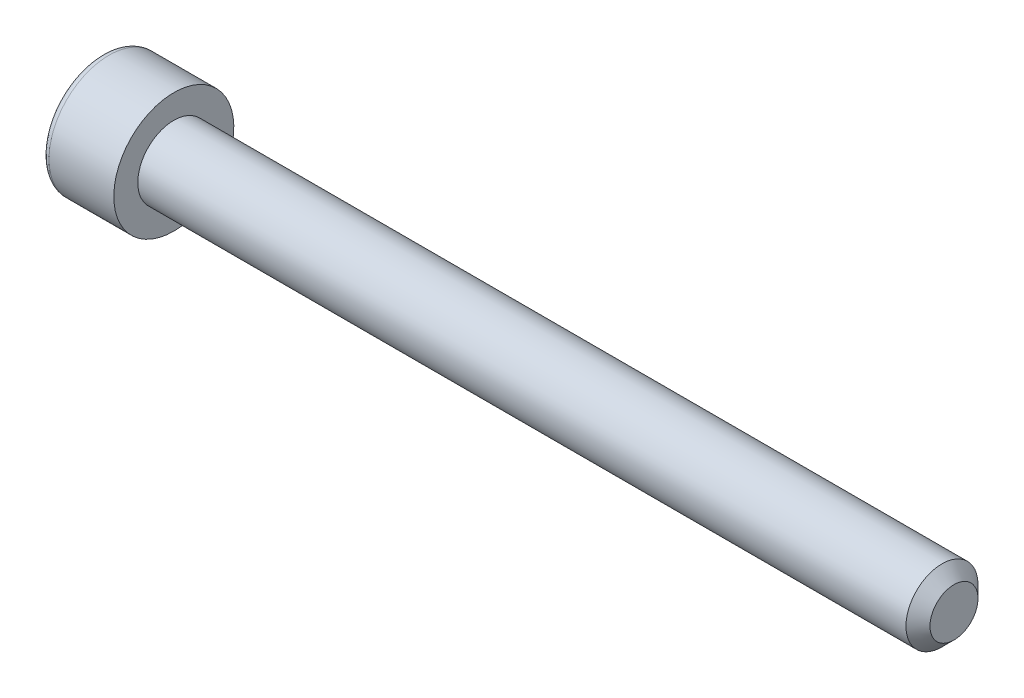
ISO-10303-21;
HEADER;
FILE_DESCRIPTION(('STEP AP214'),'2;1');
FILE_NAME('part.step','',(''),(''),'','','');
FILE_SCHEMA(('AUTOMOTIVE_DESIGN { 1 0 10303 214 1 1 1 1 }'));
ENDSEC;
DATA;
#1=APPLICATION_CONTEXT('core data for automotive mechanical design processes');
#2=APPLICATION_PROTOCOL_DEFINITION('international standard','automotive_design',2000,#1);
#3=PRODUCT_CONTEXT('',#1,'mechanical');
#4=PRODUCT('Part','Part','',(#3));
#5=PRODUCT_RELATED_PRODUCT_CATEGORY('part','',(#4));
#6=PRODUCT_DEFINITION_FORMATION('','',#4);
#7=PRODUCT_DEFINITION_CONTEXT('part definition',#1,'design');
#8=PRODUCT_DEFINITION('design','',#6,#7);
#9=PRODUCT_DEFINITION_SHAPE('','',#8);
#10=(LENGTH_UNIT() NAMED_UNIT(*) SI_UNIT(.MILLI.,.METRE.));
#11=(NAMED_UNIT(*) PLANE_ANGLE_UNIT() SI_UNIT($,.RADIAN.));
#12=(NAMED_UNIT(*) SI_UNIT($,.STERADIAN.) SOLID_ANGLE_UNIT());
#13=UNCERTAINTY_MEASURE_WITH_UNIT(LENGTH_MEASURE(1.E-05),#10,'distance_accuracy_value','');
#14=(GEOMETRIC_REPRESENTATION_CONTEXT(3) GLOBAL_UNCERTAINTY_ASSIGNED_CONTEXT((#13)) GLOBAL_UNIT_ASSIGNED_CONTEXT((#10,
#11,#12)) REPRESENTATION_CONTEXT('',''));
#15=CARTESIAN_POINT('',(0.,0.,0.));
#16=DIRECTION('',(0.,0.,1.));
#17=DIRECTION('',(1.,0.,0.));
#18=AXIS2_PLACEMENT_3D('',#15,#16,#17);
#19=CARTESIAN_POINT('',(-2.99999999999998,4.33012701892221,-2.5));
#20=DIRECTION('',(0.999999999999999,0.,0.));
#21=DIRECTION('',(0.,0.,-1.));
#22=AXIS2_PLACEMENT_3D('',#19,#20,#21);
#23=PLANE('',#22);
#24=DIRECTION('',(0.,0.499999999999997,-0.86602540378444));
#25=VECTOR('',#24,1.);
#26=CARTESIAN_POINT('',(-2.99999999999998,-2.16506350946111,-1.25000000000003));
#27=LINE('',#26,#25);
#28=CARTESIAN_POINT('',(-2.99999999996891,-2.16506350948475,-1.25000000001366));
#29=VERTEX_POINT('',#28);
#30=CARTESIAN_POINT('',(-2.99999999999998,-1.44337567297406,-2.5));
#31=VERTEX_POINT('',#30);
#32=EDGE_CURVE('E100',#29,#31,#27,.T.);
#33=ORIENTED_EDGE('',*,*,#32,.F.);
#34=CARTESIAN_POINT('',(-2.99999999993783,0.,0.));
#35=DIRECTION('',(-0.999999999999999,0.,0.));
#36=DIRECTION('',(0.,0.,1.));
#37=AXIS2_PLACEMENT_3D('',#34,#35,#36);
#38=CIRCLE('',#37,2.50000000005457);
#39=CARTESIAN_POINT('',(-2.9999999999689,0.,-2.50000000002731));
#40=VERTEX_POINT('',#39);
#41=EDGE_CURVE('E108',#29,#40,#38,.F.);
#42=ORIENTED_EDGE('',*,*,#41,.T.);
#43=DIRECTION('',(0.,1.,0.));
#44=VECTOR('',#43,1.);
#45=CARTESIAN_POINT('',(-2.99999999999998,4.33012701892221,-2.5));
#46=LINE('',#45,#44);
#47=EDGE_CURVE('E77',#31,#40,#46,.T.);
#48=ORIENTED_EDGE('',*,*,#47,.F.);
#49=EDGE_LOOP('',(#33,#42,#48));
#50=FACE_BOUND('',#49,.T.);
#51=ADVANCED_FACE('F14',(#50),#23,.F.);
#52=CARTESIAN_POINT('',(-2.99999999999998,4.33012701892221,-2.5));
#53=DIRECTION('',(0.999999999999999,0.,0.));
#54=DIRECTION('',(0.,0.,-1.));
#55=AXIS2_PLACEMENT_3D('',#52,#53,#54);
#56=PLANE('',#55);
#57=DIRECTION('',(0.,1.,0.));
#58=VECTOR('',#57,1.);
#59=CARTESIAN_POINT('',(-2.99999999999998,4.33012701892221,-2.5));
#60=LINE('',#59,#58);
#61=CARTESIAN_POINT('',(-2.99999999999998,1.44337567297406,-2.50000000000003));
#62=VERTEX_POINT('',#61);
#63=EDGE_CURVE('E259',#40,#62,#60,.T.);
#64=ORIENTED_EDGE('',*,*,#63,.F.);
#65=CARTESIAN_POINT('',(-2.99999999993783,0.,0.));
#66=DIRECTION('',(-0.999999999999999,0.,0.));
#67=DIRECTION('',(0.,0.,1.));
#68=AXIS2_PLACEMENT_3D('',#65,#66,#67);
#69=CIRCLE('',#68,2.50000000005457);
#70=CARTESIAN_POINT('',(-2.9999999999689,2.16506350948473,-1.25000000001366));
#71=VERTEX_POINT('',#70);
#72=EDGE_CURVE('E114',#40,#71,#69,.F.);
#73=ORIENTED_EDGE('',*,*,#72,.T.);
#74=DIRECTION('',(0.,0.499999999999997,0.86602540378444));
#75=VECTOR('',#74,1.);
#76=CARTESIAN_POINT('',(-2.99999999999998,1.44337567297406,-2.50000000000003));
#77=LINE('',#76,#75);
#78=EDGE_CURVE('E257',#62,#71,#77,.T.);
#79=ORIENTED_EDGE('',*,*,#78,.F.);
#80=EDGE_LOOP('',(#64,#73,#79));
#81=FACE_BOUND('',#80,.T.);
#82=ADVANCED_FACE('F261',(#81),#56,.F.);
#83=CARTESIAN_POINT('',(-2.99999999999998,4.33012701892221,-2.5));
#84=DIRECTION('',(0.999999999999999,0.,0.));
#85=DIRECTION('',(0.,0.,-1.));
#86=AXIS2_PLACEMENT_3D('',#83,#84,#85);
#87=PLANE('',#86);
#88=DIRECTION('',(0.,1.,0.));
#89=VECTOR('',#88,1.);
#90=CARTESIAN_POINT('',(-2.99999999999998,4.33012701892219,2.5));
#91=LINE('',#90,#89);
#92=CARTESIAN_POINT('',(-2.99999999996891,0.,2.50000000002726));
#93=VERTEX_POINT('',#92);
#94=CARTESIAN_POINT('',(-2.99999999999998,-1.44337567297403,2.5));
#95=VERTEX_POINT('',#94);
#96=EDGE_CURVE('E119',#93,#95,#91,.F.);
#97=ORIENTED_EDGE('',*,*,#96,.F.);
#98=CARTESIAN_POINT('',(-2.99999999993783,0.,0.));
#99=DIRECTION('',(-0.999999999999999,0.,0.));
#100=DIRECTION('',(0.,0.,1.));
#101=AXIS2_PLACEMENT_3D('',#98,#99,#100);
#102=CIRCLE('',#101,2.50000000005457);
#103=CARTESIAN_POINT('',(-2.99999999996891,-2.16506350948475,1.25000000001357));
#104=VERTEX_POINT('',#103);
#105=EDGE_CURVE('E94',#93,#104,#102,.F.);
#106=ORIENTED_EDGE('',*,*,#105,.T.);
#107=DIRECTION('',(0.,-0.499999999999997,-0.86602540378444));
#108=VECTOR('',#107,1.);
#109=CARTESIAN_POINT('',(-2.99999999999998,-1.44337567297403,2.5));
#110=LINE('',#109,#108);
#111=EDGE_CURVE('E115',#95,#104,#110,.T.);
#112=ORIENTED_EDGE('',*,*,#111,.F.);
#113=EDGE_LOOP('',(#97,#106,#112));
#114=FACE_BOUND('',#113,.T.);
#115=ADVANCED_FACE('F283',(#114),#87,.F.);
#116=CARTESIAN_POINT('',(-2.9999999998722,0.,0.));
#117=DIRECTION('',(-0.999999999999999,0.,0.));
#118=DIRECTION('',(0.,0.,1.));
#119=AXIS2_PLACEMENT_3D('',#116,#117,#118);
#120=CONICAL_SURFACE('',#119,2.49999999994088,1.04719755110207);
#121=CARTESIAN_POINT('',(-1.55662432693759,7.10265180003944E-11,0.));
#122=VERTEX_POINT('',#121);
#123=VERTEX_LOOP('',#122);
#124=FACE_BOUND('',#123,.T.);
#125=ORIENTED_EDGE('',*,*,#41,.F.);
#126=CARTESIAN_POINT('',(-2.99999999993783,0.,0.));
#127=DIRECTION('',(-0.999999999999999,0.,0.));
#128=DIRECTION('',(0.,0.,1.));
#129=AXIS2_PLACEMENT_3D('',#126,#127,#128);
#130=CIRCLE('',#129,2.50000000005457);
#131=EDGE_CURVE('E83',#104,#29,#130,.F.);
#132=ORIENTED_EDGE('',*,*,#131,.F.);
#133=ORIENTED_EDGE('',*,*,#105,.F.);
#134=CARTESIAN_POINT('',(-2.99999999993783,0.,0.));
#135=DIRECTION('',(-0.999999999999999,0.,0.));
#136=DIRECTION('',(0.,0.,1.));
#137=AXIS2_PLACEMENT_3D('',#134,#135,#136);
#138=CIRCLE('',#137,2.50000000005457);
#139=CARTESIAN_POINT('',(-2.99999999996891,2.16506350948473,1.25000000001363));
#140=VERTEX_POINT('',#139);
#141=EDGE_CURVE('E93',#93,#140,#138,.T.);
#142=ORIENTED_EDGE('',*,*,#141,.T.);
#143=CARTESIAN_POINT('',(-2.99999999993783,0.,0.));
#144=DIRECTION('',(-0.999999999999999,0.,0.));
#145=DIRECTION('',(0.,0.,1.));
#146=AXIS2_PLACEMENT_3D('',#143,#144,#145);
#147=CIRCLE('',#146,2.50000000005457);
#148=EDGE_CURVE('E117',#71,#140,#147,.F.);
#149=ORIENTED_EDGE('',*,*,#148,.F.);
#150=ORIENTED_EDGE('',*,*,#72,.F.);
#151=EDGE_LOOP('',(#125,#132,#133,#142,#149,#150));
#152=FACE_BOUND('',#151,.T.);
#153=ADVANCED_FACE('F112',(#124,#152),#120,.F.);
#154=CARTESIAN_POINT('',(-2.99999999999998,4.33012701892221,-2.5));
#155=DIRECTION('',(0.999999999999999,0.,0.));
#156=DIRECTION('',(0.,0.,-1.));
#157=AXIS2_PLACEMENT_3D('',#154,#155,#156);
#158=PLANE('',#157);
#159=DIRECTION('',(0.,0.499999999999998,-0.86602540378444));
#160=VECTOR('',#159,1.);
#161=CARTESIAN_POINT('',(-2.99999999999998,1.44337567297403,2.49999999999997));
#162=LINE('',#161,#160);
#163=CARTESIAN_POINT('',(-2.99999999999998,1.44337567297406,2.49999999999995));
#164=VERTEX_POINT('',#163);
#165=EDGE_CURVE('E201',#140,#164,#162,.F.);
#166=ORIENTED_EDGE('',*,*,#165,.F.);
#167=ORIENTED_EDGE('',*,*,#141,.F.);
#168=DIRECTION('',(0.,1.,0.));
#169=VECTOR('',#168,1.);
#170=CARTESIAN_POINT('',(-2.99999999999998,-1.44337567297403,2.5));
#171=LINE('',#170,#169);
#172=EDGE_CURVE('E202',#164,#93,#171,.F.);
#173=ORIENTED_EDGE('',*,*,#172,.F.);
#174=EDGE_LOOP('',(#166,#167,#173));
#175=FACE_BOUND('',#174,.T.);
#176=ADVANCED_FACE('F243',(#175),#158,.F.);
#177=CARTESIAN_POINT('',(-2.99999999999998,4.33012701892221,-2.5));
#178=DIRECTION('',(0.999999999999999,0.,0.));
#179=DIRECTION('',(0.,0.,-1.));
#180=AXIS2_PLACEMENT_3D('',#177,#178,#179);
#181=PLANE('',#180);
#182=DIRECTION('',(0.,-0.499999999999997,-0.86602540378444));
#183=VECTOR('',#182,1.);
#184=CARTESIAN_POINT('',(-2.99999999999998,1.44337567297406,-2.50000000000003));
#185=LINE('',#184,#183);
#186=CARTESIAN_POINT('',(-2.99999999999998,2.88675134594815,0.));
#187=VERTEX_POINT('',#186);
#188=EDGE_CURVE('E187',#71,#187,#185,.F.);
#189=ORIENTED_EDGE('',*,*,#188,.F.);
#190=ORIENTED_EDGE('',*,*,#148,.T.);
#191=DIRECTION('',(0.,0.499999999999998,-0.86602540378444));
#192=VECTOR('',#191,1.);
#193=CARTESIAN_POINT('',(-2.99999999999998,1.44337567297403,2.49999999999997));
#194=LINE('',#193,#192);
#195=EDGE_CURVE('E198',#187,#140,#194,.F.);
#196=ORIENTED_EDGE('',*,*,#195,.F.);
#197=EDGE_LOOP('',(#189,#190,#196));
#198=FACE_BOUND('',#197,.T.);
#199=ADVANCED_FACE('F237',(#198),#181,.F.);
#200=CARTESIAN_POINT('',(-2.99999999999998,4.33012701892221,-2.5));
#201=DIRECTION('',(0.999999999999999,0.,0.));
#202=DIRECTION('',(0.,0.,-1.));
#203=AXIS2_PLACEMENT_3D('',#200,#201,#202);
#204=PLANE('',#203);
#205=DIRECTION('',(0.,0.499999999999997,0.86602540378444));
#206=VECTOR('',#205,1.);
#207=CARTESIAN_POINT('',(-2.99999999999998,-1.44337567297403,2.5));
#208=LINE('',#207,#206);
#209=CARTESIAN_POINT('',(-2.99999999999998,-2.8867513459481,0.));
#210=VERTEX_POINT('',#209);
#211=EDGE_CURVE('E89',#104,#210,#208,.F.);
#212=ORIENTED_EDGE('',*,*,#211,.F.);
#213=ORIENTED_EDGE('',*,*,#131,.T.);
#214=DIRECTION('',(0.,-0.499999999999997,0.86602540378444));
#215=VECTOR('',#214,1.);
#216=CARTESIAN_POINT('',(-2.99999999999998,-1.44337567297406,-2.5));
#217=LINE('',#216,#215);
#218=EDGE_CURVE('E86',#210,#29,#217,.F.);
#219=ORIENTED_EDGE('',*,*,#218,.F.);
#220=EDGE_LOOP('',(#212,#213,#219));
#221=FACE_BOUND('',#220,.T.);
#222=ADVANCED_FACE('F85',(#221),#204,.F.);
#223=CARTESIAN_POINT('',(-2.99999999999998,-1.44337567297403,2.5));
#224=DIRECTION('',(0.,0.,-1.));
#225=DIRECTION('',(-0.999999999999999,0.,0.));
#226=AXIS2_PLACEMENT_3D('',#223,#224,#225);
#227=PLANE('',#226);
#228=ORIENTED_EDGE('',*,*,#96,.T.);
#229=DIRECTION('',(0.999999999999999,0.,0.));
#230=VECTOR('',#229,1.);
#231=CARTESIAN_POINT('',(-2.99999999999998,-1.44337567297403,2.5));
#232=LINE('',#231,#230);
#233=CARTESIAN_POINT('',(-5.99999999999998,-1.44337567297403,2.5));
#234=VERTEX_POINT('',#233);
#235=EDGE_CURVE('E179',#234,#95,#232,.T.);
#236=ORIENTED_EDGE('',*,*,#235,.F.);
#237=DIRECTION('',(0.,1.,0.));
#238=VECTOR('',#237,1.);
#239=CARTESIAN_POINT('',(-5.99999999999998,-2.50000000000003,2.49999999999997));
#240=LINE('',#239,#238);
#241=CARTESIAN_POINT('',(-5.99999999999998,1.44337567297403,2.49999999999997));
#242=VERTEX_POINT('',#241);
#243=EDGE_CURVE('E163',#234,#242,#240,.T.);
#244=ORIENTED_EDGE('',*,*,#243,.T.);
#245=DIRECTION('',(0.999999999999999,0.,0.));
#246=VECTOR('',#245,1.);
#247=CARTESIAN_POINT('',(-2.99999999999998,1.44337567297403,2.49999999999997));
#248=LINE('',#247,#246);
#249=EDGE_CURVE('E191',#164,#242,#248,.F.);
#250=ORIENTED_EDGE('',*,*,#249,.F.);
#251=ORIENTED_EDGE('',*,*,#172,.T.);
#252=EDGE_LOOP('',(#228,#236,#244,#250,#251));
#253=FACE_BOUND('',#252,.T.);
#254=ADVANCED_FACE('F275',(#253),#227,.T.);
#255=CARTESIAN_POINT('',(-2.99999999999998,1.44337567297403,2.49999999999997));
#256=DIRECTION('',(0.,-0.86602540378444,-0.499999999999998));
#257=DIRECTION('',(0.,0.499999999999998,-0.86602540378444));
#258=AXIS2_PLACEMENT_3D('',#255,#256,#257);
#259=PLANE('',#258);
#260=ORIENTED_EDGE('',*,*,#165,.T.);
#261=ORIENTED_EDGE('',*,*,#249,.T.);
#262=DIRECTION('',(0.,0.499999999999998,-0.86602540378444));
#263=VECTOR('',#262,1.);
#264=CARTESIAN_POINT('',(-5.99999999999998,1.44337567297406,2.49999999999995));
#265=LINE('',#264,#263);
#266=CARTESIAN_POINT('',(-5.99999999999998,2.88675134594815,0.));
#267=VERTEX_POINT('',#266);
#268=EDGE_CURVE('E250',#242,#267,#265,.T.);
#269=ORIENTED_EDGE('',*,*,#268,.T.);
#270=DIRECTION('',(0.999999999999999,0.,0.));
#271=VECTOR('',#270,1.);
#272=CARTESIAN_POINT('',(-2.99999999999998,2.88675134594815,0.));
#273=LINE('',#272,#271);
#274=EDGE_CURVE('E190',#187,#267,#273,.F.);
#275=ORIENTED_EDGE('',*,*,#274,.F.);
#276=ORIENTED_EDGE('',*,*,#195,.T.);
#277=EDGE_LOOP('',(#260,#261,#269,#275,#276));
#278=FACE_BOUND('',#277,.T.);
#279=ADVANCED_FACE('F246',(#278),#259,.T.);
#280=CARTESIAN_POINT('',(-2.99999999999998,1.44337567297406,-2.50000000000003));
#281=DIRECTION('',(0.,-0.86602540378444,0.499999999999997));
#282=DIRECTION('',(0.,-0.499999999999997,-0.86602540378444));
#283=AXIS2_PLACEMENT_3D('',#280,#281,#282);
#284=PLANE('',#283);
#285=ORIENTED_EDGE('',*,*,#188,.T.);
#286=ORIENTED_EDGE('',*,*,#274,.T.);
#287=DIRECTION('',(0.,-0.499999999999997,-0.86602540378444));
#288=VECTOR('',#287,1.);
#289=CARTESIAN_POINT('',(-5.99999999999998,2.88675134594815,0.));
#290=LINE('',#289,#288);
#291=CARTESIAN_POINT('',(-5.99999999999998,1.44337567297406,-2.50000000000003));
#292=VERTEX_POINT('',#291);
#293=EDGE_CURVE('E432',#267,#292,#290,.T.);
#294=ORIENTED_EDGE('',*,*,#293,.T.);
#295=DIRECTION('',(0.999999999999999,0.,0.));
#296=VECTOR('',#295,1.);
#297=CARTESIAN_POINT('',(-2.99999999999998,1.44337567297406,-2.50000000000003));
#298=LINE('',#297,#296);
#299=EDGE_CURVE('E105',#62,#292,#298,.F.);
#300=ORIENTED_EDGE('',*,*,#299,.F.);
#301=ORIENTED_EDGE('',*,*,#78,.T.);
#302=EDGE_LOOP('',(#285,#286,#294,#300,#301));
#303=FACE_BOUND('',#302,.T.);
#304=ADVANCED_FACE('F254',(#303),#284,.T.);
#305=CARTESIAN_POINT('',(-2.99999999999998,-1.44337567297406,-2.5));
#306=DIRECTION('',(0.,0.,1.));
#307=DIRECTION('',(0.999999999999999,0.,0.));
#308=AXIS2_PLACEMENT_3D('',#305,#306,#307);
#309=PLANE('',#308);
#310=ORIENTED_EDGE('',*,*,#63,.T.);
#311=ORIENTED_EDGE('',*,*,#299,.T.);
#312=DIRECTION('',(0.,1.,0.));
#313=VECTOR('',#312,1.);
#314=CARTESIAN_POINT('',(-5.99999999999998,-2.5,-2.50000000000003));
#315=LINE('',#314,#313);
#316=CARTESIAN_POINT('',(-5.99999999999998,-1.44337567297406,-2.5));
#317=VERTEX_POINT('',#316);
#318=EDGE_CURVE('E433',#292,#317,#315,.F.);
#319=ORIENTED_EDGE('',*,*,#318,.T.);
#320=DIRECTION('',(0.999999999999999,0.,0.));
#321=VECTOR('',#320,1.);
#322=CARTESIAN_POINT('',(-2.99999999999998,-1.44337567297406,-2.5));
#323=LINE('',#322,#321);
#324=EDGE_CURVE('E104',#31,#317,#323,.F.);
#325=ORIENTED_EDGE('',*,*,#324,.F.);
#326=ORIENTED_EDGE('',*,*,#47,.T.);
#327=EDGE_LOOP('',(#310,#311,#319,#325,#326));
#328=FACE_BOUND('',#327,.T.);
#329=ADVANCED_FACE('F356',(#328),#309,.T.);
#330=CARTESIAN_POINT('',(-2.99999999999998,-1.44337567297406,-2.5));
#331=DIRECTION('',(0.,0.86602540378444,0.499999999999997));
#332=DIRECTION('',(0.,-0.499999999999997,0.86602540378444));
#333=AXIS2_PLACEMENT_3D('',#330,#331,#332);
#334=PLANE('',#333);
#335=ORIENTED_EDGE('',*,*,#32,.T.);
#336=ORIENTED_EDGE('',*,*,#324,.T.);
#337=DIRECTION('',(0.,-0.499999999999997,0.86602540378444));
#338=VECTOR('',#337,1.);
#339=CARTESIAN_POINT('',(-5.99999999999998,-1.44337567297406,-2.5));
#340=LINE('',#339,#338);
#341=CARTESIAN_POINT('',(-5.99999999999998,-2.8867513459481,0.));
#342=VERTEX_POINT('',#341);
#343=EDGE_CURVE('E436',#317,#342,#340,.T.);
#344=ORIENTED_EDGE('',*,*,#343,.T.);
#345=DIRECTION('',(0.999999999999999,0.,0.));
#346=VECTOR('',#345,1.);
#347=CARTESIAN_POINT('',(-2.99999999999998,-2.8867513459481,0.));
#348=LINE('',#347,#346);
#349=EDGE_CURVE('E103',#210,#342,#348,.F.);
#350=ORIENTED_EDGE('',*,*,#349,.F.);
#351=ORIENTED_EDGE('',*,*,#218,.T.);
#352=EDGE_LOOP('',(#335,#336,#344,#350,#351));
#353=FACE_BOUND('',#352,.T.);
#354=ADVANCED_FACE('F98',(#353),#334,.T.);
#355=CARTESIAN_POINT('',(-2.99999999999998,-1.44337567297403,2.5));
#356=DIRECTION('',(0.,0.86602540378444,-0.499999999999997));
#357=DIRECTION('',(0.,0.499999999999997,0.86602540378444));
#358=AXIS2_PLACEMENT_3D('',#355,#356,#357);
#359=PLANE('',#358);
#360=ORIENTED_EDGE('',*,*,#211,.T.);
#361=ORIENTED_EDGE('',*,*,#349,.T.);
#362=DIRECTION('',(0.,0.499999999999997,0.86602540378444));
#363=VECTOR('',#362,1.);
#364=CARTESIAN_POINT('',(-5.99999999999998,-2.8867513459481,0.));
#365=LINE('',#364,#363);
#366=EDGE_CURVE('E127',#342,#234,#365,.T.);
#367=ORIENTED_EDGE('',*,*,#366,.T.);
#368=ORIENTED_EDGE('',*,*,#235,.T.);
#369=ORIENTED_EDGE('',*,*,#111,.T.);
#370=EDGE_LOOP('',(#360,#361,#367,#368,#369));
#371=FACE_BOUND('',#370,.T.);
#372=ADVANCED_FACE('F148',(#371),#359,.T.);
#373=CARTESIAN_POINT('',(-5.99999999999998,-2.50000000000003,0.));
#374=DIRECTION('',(0.999999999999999,0.,0.));
#375=DIRECTION('',(0.,1.,0.));
#376=AXIS2_PLACEMENT_3D('',#373,#374,#375);
#377=PLANE('',#376);
#378=ORIENTED_EDGE('',*,*,#343,.F.);
#379=ORIENTED_EDGE('',*,*,#318,.F.);
#380=ORIENTED_EDGE('',*,*,#293,.F.);
#381=ORIENTED_EDGE('',*,*,#268,.F.);
#382=ORIENTED_EDGE('',*,*,#243,.F.);
#383=ORIENTED_EDGE('',*,*,#366,.F.);
#384=EDGE_LOOP('',(#378,#379,#380,#381,#382,#383));
#385=FACE_BOUND('',#384,.T.);
#386=CARTESIAN_POINT('',(-5.99999999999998,0.,0.));
#387=DIRECTION('',(0.999999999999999,0.,0.));
#388=DIRECTION('',(0.,1.,0.));
#389=AXIS2_PLACEMENT_3D('',#386,#387,#388);
#390=CIRCLE('',#389,4.39999999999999);
#391=CARTESIAN_POINT('',(-5.99999999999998,4.39999999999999,0.));
#392=VERTEX_POINT('',#391);
#393=CARTESIAN_POINT('',(-5.99999999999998,-4.40000000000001,0.));
#394=VERTEX_POINT('',#393);
#395=EDGE_CURVE('E34',#392,#394,#390,.T.);
#396=ORIENTED_EDGE('',*,*,#395,.F.);
#397=CARTESIAN_POINT('',(-5.99999999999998,0.,0.));
#398=DIRECTION('',(0.999999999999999,0.,0.));
#399=DIRECTION('',(0.,-1.,0.));
#400=AXIS2_PLACEMENT_3D('',#397,#398,#399);
#401=CIRCLE('',#400,4.39999999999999);
#402=EDGE_CURVE('E125',#394,#392,#401,.T.);
#403=ORIENTED_EDGE('',*,*,#402,.F.);
#404=EDGE_LOOP('',(#396,#403));
#405=FACE_BOUND('',#404,.T.);
#406=ADVANCED_FACE('F129',(#385,#405),#377,.F.);
#407=CARTESIAN_POINT('',(-5.39999999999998,0.,0.));
#408=DIRECTION('',(-0.999999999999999,0.,0.));
#409=DIRECTION('',(0.,1.,0.));
#410=AXIS2_PLACEMENT_3D('',#407,#408,#409);
#411=TOROIDAL_SURFACE('',#410,4.39999999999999,0.6);
#412=ORIENTED_EDGE('',*,*,#395,.T.);
#413=ORIENTED_EDGE('',*,*,#402,.T.);
#414=EDGE_LOOP('',(#412,#413));
#415=FACE_BOUND('',#414,.T.);
#416=CARTESIAN_POINT('',(-5.39999999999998,0.,0.));
#417=DIRECTION('',(-0.999999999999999,0.,0.));
#418=DIRECTION('',(0.,-1.,0.));
#419=AXIS2_PLACEMENT_3D('',#416,#417,#418);
#420=CIRCLE('',#419,5.);
#421=CARTESIAN_POINT('',(-5.39999999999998,-5.,0.));
#422=VERTEX_POINT('',#421);
#423=EDGE_CURVE('E130',#422,#422,#420,.F.);
#424=ORIENTED_EDGE('',*,*,#423,.F.);
#425=EDGE_LOOP('',(#424));
#426=FACE_BOUND('',#425,.T.);
#427=ADVANCED_FACE('F123',(#415,#426),#411,.T.);
#428=CARTESIAN_POINT('',(64.9999999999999,0.,0.));
#429=DIRECTION('',(-0.999999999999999,0.,0.));
#430=DIRECTION('',(0.,0.,1.));
#431=AXIS2_PLACEMENT_3D('',#428,#429,#430);
#432=PLANE('',#431);
#433=CARTESIAN_POINT('',(64.9999999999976,0.,0.));
#434=DIRECTION('',(-0.999999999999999,0.,0.));
#435=DIRECTION('',(0.,0.,1.));
#436=AXIS2_PLACEMENT_3D('',#433,#434,#435);
#437=CIRCLE('',#436,2.00000000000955);
#438=CARTESIAN_POINT('',(64.9999999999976,0.,2.00000000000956));
#439=VERTEX_POINT('',#438);
#440=EDGE_CURVE('E169',#439,#439,#437,.T.);
#441=ORIENTED_EDGE('',*,*,#440,.F.);
#442=EDGE_LOOP('',(#441));
#443=FACE_BOUND('',#442,.T.);
#444=ADVANCED_FACE('F156',(#443),#432,.F.);
#445=CARTESIAN_POINT('',(-5.99999999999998,0.,0.));
#446=DIRECTION('',(-0.999999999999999,0.,0.));
#447=DIRECTION('',(0.,-1.,0.));
#448=AXIS2_PLACEMENT_3D('',#445,#446,#447);
#449=CYLINDRICAL_SURFACE('',#448,5.);
#450=CARTESIAN_POINT('',(0.,0.,0.));
#451=DIRECTION('',(-0.999999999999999,0.,0.));
#452=DIRECTION('',(0.,-1.,0.));
#453=AXIS2_PLACEMENT_3D('',#450,#451,#452);
#454=CIRCLE('',#453,5.);
#455=CARTESIAN_POINT('',(0.,-5.,0.));
#456=VERTEX_POINT('',#455);
#457=EDGE_CURVE('E167',#456,#456,#454,.T.);
#458=CARTESIAN_POINT('',(-5.39999999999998,-5.,0.));
#459=CARTESIAN_POINT('',(-5.34374999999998,-5.,0.));
#460=CARTESIAN_POINT('',(-5.28749999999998,-5.,0.));
#461=CARTESIAN_POINT('',(-5.17499999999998,-5.,0.));
#462=CARTESIAN_POINT('',(-5.11874999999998,-5.,0.));
#463=CARTESIAN_POINT('',(-5.00624999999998,-5.,0.));
#464=CARTESIAN_POINT('',(-4.94999999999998,-5.,0.));
#465=CARTESIAN_POINT('',(-4.83749999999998,-5.,0.));
#466=CARTESIAN_POINT('',(-4.78124999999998,-5.,0.));
#467=CARTESIAN_POINT('',(-4.66874999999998,-5.,0.));
#468=CARTESIAN_POINT('',(-4.61249999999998,-5.,0.));
#469=CARTESIAN_POINT('',(-4.49999999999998,-5.,0.));
#470=CARTESIAN_POINT('',(-4.44374999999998,-5.,0.));
#471=CARTESIAN_POINT('',(-4.33124999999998,-5.,0.));
#472=CARTESIAN_POINT('',(-4.27499999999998,-5.,0.));
#473=CARTESIAN_POINT('',(-4.16249999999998,-5.,0.));
#474=CARTESIAN_POINT('',(-4.10624999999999,-5.,0.));
#475=CARTESIAN_POINT('',(-3.99374999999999,-5.,0.));
#476=CARTESIAN_POINT('',(-3.93749999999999,-5.,0.));
#477=CARTESIAN_POINT('',(-3.82499999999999,-5.,0.));
#478=CARTESIAN_POINT('',(-3.76874999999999,-5.,0.));
#479=CARTESIAN_POINT('',(-3.65624999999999,-5.,0.));
#480=CARTESIAN_POINT('',(-3.59999999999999,-5.,0.));
#481=CARTESIAN_POINT('',(-3.48749999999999,-5.,0.));
#482=CARTESIAN_POINT('',(-3.43124999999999,-5.,0.));
#483=CARTESIAN_POINT('',(-3.31874999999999,-5.,0.));
#484=CARTESIAN_POINT('',(-3.26249999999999,-5.,0.));
#485=CARTESIAN_POINT('',(-3.14999999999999,-5.,0.));
#486=CARTESIAN_POINT('',(-3.09374999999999,-5.,0.));
#487=CARTESIAN_POINT('',(-2.98124999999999,-5.,0.));
#488=CARTESIAN_POINT('',(-2.92499999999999,-5.,0.));
#489=CARTESIAN_POINT('',(-2.81249999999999,-5.,0.));
#490=CARTESIAN_POINT('',(-2.75624999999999,-5.,0.));
#491=CARTESIAN_POINT('',(-2.64374999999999,-5.,0.));
#492=CARTESIAN_POINT('',(-2.58749999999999,-5.,0.));
#493=CARTESIAN_POINT('',(-2.47499999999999,-5.,0.));
#494=CARTESIAN_POINT('',(-2.41874999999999,-5.,0.));
#495=CARTESIAN_POINT('',(-2.30624999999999,-5.,0.));
#496=CARTESIAN_POINT('',(-2.24999999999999,-5.,0.));
#497=CARTESIAN_POINT('',(-2.13749999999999,-5.,0.));
#498=CARTESIAN_POINT('',(-2.08124999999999,-5.,0.));
#499=CARTESIAN_POINT('',(-1.96874999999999,-5.,0.));
#500=CARTESIAN_POINT('',(-1.91249999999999,-5.,0.));
#501=CARTESIAN_POINT('',(-1.79999999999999,-5.,0.));
#502=CARTESIAN_POINT('',(-1.74374999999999,-5.,0.));
#503=CARTESIAN_POINT('',(-1.63124999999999,-5.,0.));
#504=CARTESIAN_POINT('',(-1.57499999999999,-5.,0.));
#505=CARTESIAN_POINT('',(-1.46249999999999,-5.,0.));
#506=CARTESIAN_POINT('',(-1.40624999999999,-5.,0.));
#507=CARTESIAN_POINT('',(-1.29374999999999,-5.,0.));
#508=CARTESIAN_POINT('',(-1.23749999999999,-5.,0.));
#509=CARTESIAN_POINT('',(-1.12499999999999,-5.,0.));
#510=CARTESIAN_POINT('',(-1.06874999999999,-5.,0.));
#511=CARTESIAN_POINT('',(-0.956249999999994,-5.,0.));
#512=CARTESIAN_POINT('',(-0.899999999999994,-5.,0.));
#513=CARTESIAN_POINT('',(-0.787499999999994,-5.,0.));
#514=CARTESIAN_POINT('',(-0.731249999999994,-5.,0.));
#515=CARTESIAN_POINT('',(-0.618749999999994,-5.,0.));
#516=CARTESIAN_POINT('',(-0.562499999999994,-5.,0.));
#517=CARTESIAN_POINT('',(-0.449999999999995,-5.,0.));
#518=CARTESIAN_POINT('',(-0.393749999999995,-5.,0.));
#519=CARTESIAN_POINT('',(-0.281249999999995,-5.,0.));
#520=CARTESIAN_POINT('',(-0.224999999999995,-5.,0.));
#521=CARTESIAN_POINT('',(-0.112499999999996,-5.,0.));
#522=CARTESIAN_POINT('',(-0.0562499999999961,-5.,0.));
#523=CARTESIAN_POINT('',(0.,-5.,0.));
#524=B_SPLINE_CURVE_WITH_KNOTS('',3,(#458,#459,#460,#461,#462,#463,#464,#465,#466,#467,#468,
#469,#470,#471,#472,#473,#474,#475,#476,#477,#478,#479,#480,#481,#482,#483,#484,#485,#486,#487,
#488,#489,#490,#491,#492,#493,#494,#495,#496,#497,#498,#499,#500,#501,#502,#503,#504,#505,#506,
#507,#508,#509,#510,#511,#512,#513,#514,#515,#516,#517,#518,#519,#520,#521,#522,#523),
.UNSPECIFIED.,.F.,.F.,(4,2,2,2,2,2,2,2,2,2,2,2,2,2,2,2,2,2,2,2,2,2,2,2,2,2,2,2,2,2,2,2,4),(0.,
0.168749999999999,0.337499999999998,0.506249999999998,0.674999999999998,0.843749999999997,
1.0125,1.18125,1.35,1.51875,1.68749999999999,1.85624999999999,2.02499999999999,2.19374999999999,
2.36249999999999,2.53124999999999,2.69999999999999,2.86874999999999,3.03749999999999,
3.20624999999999,3.37499999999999,3.54374999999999,3.71249999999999,3.88124999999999,
4.04999999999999,4.21874999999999,4.38749999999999,4.55624999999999,4.72499999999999,
4.89374999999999,5.06249999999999,5.23124999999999,5.39999999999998),.UNSPECIFIED.);
#525=EDGE_CURVE('BSEAM308',#422,#456,#524,.T.);
#526=ORIENTED_EDGE('',*,*,#423,.T.);
#527=ORIENTED_EDGE('',*,*,#457,.T.);
#528=ORIENTED_EDGE('',*,*,#525,.T.);
#529=ORIENTED_EDGE('',*,*,#525,.F.);
#530=EDGE_LOOP('',(#526,#528,#527,#529));
#531=FACE_BOUND('',#530,.T.);
#532=ADVANCED_FACE('F308',(#531),#449,.T.);
#533=CARTESIAN_POINT('',(63.9999999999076,0.,0.));
#534=DIRECTION('',(-0.999999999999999,0.,0.));
#535=DIRECTION('',(0.,0.,1.));
#536=AXIS2_PLACEMENT_3D('',#533,#534,#535);
#537=CONICAL_SURFACE('',#536,3.00000000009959,0.785398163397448);
#538=CARTESIAN_POINT('',(63.9999999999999,0.,0.));
#539=DIRECTION('',(-0.999999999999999,0.,0.));
#540=DIRECTION('',(0.,0.,1.));
#541=AXIS2_PLACEMENT_3D('',#538,#539,#540);
#542=CIRCLE('',#541,3.);
#543=CARTESIAN_POINT('',(63.9999999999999,0.,3.0000000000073));
#544=VERTEX_POINT('',#543);
#545=EDGE_CURVE('E26',#544,#544,#542,.T.);
#546=CARTESIAN_POINT('',(64.9999999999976,0.,2.00000000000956));
#547=CARTESIAN_POINT('',(64.989583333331,0.,2.0104166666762));
#548=CARTESIAN_POINT('',(64.9791666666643,0.,2.02083333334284));
#549=CARTESIAN_POINT('',(64.9583333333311,0.,2.04166666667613));
#550=CARTESIAN_POINT('',(64.9479166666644,0.,2.05208333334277));
#551=CARTESIAN_POINT('',(64.9270833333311,0.,2.07291666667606));
#552=CARTESIAN_POINT('',(64.9166666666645,0.,2.0833333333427));
#553=CARTESIAN_POINT('',(64.8958333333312,0.,2.10416666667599));
#554=CARTESIAN_POINT('',(64.8854166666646,0.,2.11458333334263));
#555=CARTESIAN_POINT('',(64.8645833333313,0.,2.13541666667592));
#556=CARTESIAN_POINT('',(64.8541666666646,0.,2.14583333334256));
#557=CARTESIAN_POINT('',(64.8333333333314,0.,2.16666666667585));
#558=CARTESIAN_POINT('',(64.8229166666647,0.,2.17708333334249));
#559=CARTESIAN_POINT('',(64.8020833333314,0.,2.19791666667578));
#560=CARTESIAN_POINT('',(64.7916666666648,0.,2.20833333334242));
#561=CARTESIAN_POINT('',(64.7708333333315,0.,2.2291666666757));
#562=CARTESIAN_POINT('',(64.7604166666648,0.,2.23958333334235));
#563=CARTESIAN_POINT('',(64.7395833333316,0.,2.26041666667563));
#564=CARTESIAN_POINT('',(64.7291666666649,0.,2.27083333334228));
#565=CARTESIAN_POINT('',(64.7083333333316,0.,2.29166666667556));
#566=CARTESIAN_POINT('',(64.697916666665,0.,2.30208333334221));
#567=CARTESIAN_POINT('',(64.6770833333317,0.,2.32291666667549));
#568=CARTESIAN_POINT('',(64.6666666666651,0.,2.33333333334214));
#569=CARTESIAN_POINT('',(64.6458333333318,0.,2.35416666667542));
#570=CARTESIAN_POINT('',(64.6354166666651,0.,2.36458333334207));
#571=CARTESIAN_POINT('',(64.6145833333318,0.,2.38541666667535));
#572=CARTESIAN_POINT('',(64.6041666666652,0.,2.39583333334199));
#573=CARTESIAN_POINT('',(64.5833333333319,0.,2.41666666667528));
#574=CARTESIAN_POINT('',(64.5729166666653,0.,2.42708333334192));
#575=CARTESIAN_POINT('',(64.552083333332,0.,2.44791666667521));
#576=CARTESIAN_POINT('',(64.5416666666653,0.,2.45833333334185));
#577=CARTESIAN_POINT('',(64.520833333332,0.,2.47916666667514));
#578=CARTESIAN_POINT('',(64.5104166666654,0.,2.48958333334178));
#579=CARTESIAN_POINT('',(64.4895833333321,0.,2.51041666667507));
#580=CARTESIAN_POINT('',(64.4791666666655,0.,2.52083333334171));
#581=CARTESIAN_POINT('',(64.4583333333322,0.,2.541666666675));
#582=CARTESIAN_POINT('',(64.4479166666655,0.,2.55208333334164));
#583=CARTESIAN_POINT('',(64.4270833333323,0.,2.57291666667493));
#584=CARTESIAN_POINT('',(64.4166666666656,0.,2.58333333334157));
#585=CARTESIAN_POINT('',(64.3958333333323,0.,2.60416666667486));
#586=CARTESIAN_POINT('',(64.3854166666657,0.,2.6145833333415));
#587=CARTESIAN_POINT('',(64.3645833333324,0.,2.63541666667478));
#588=CARTESIAN_POINT('',(64.3541666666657,0.,2.64583333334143));
#589=CARTESIAN_POINT('',(64.3333333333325,0.,2.66666666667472));
#590=CARTESIAN_POINT('',(64.3229166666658,0.,2.67708333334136));
#591=CARTESIAN_POINT('',(64.3020833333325,0.,2.69791666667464));
#592=CARTESIAN_POINT('',(64.2916666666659,0.,2.70833333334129));
#593=CARTESIAN_POINT('',(64.2708333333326,0.,2.72916666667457));
#594=CARTESIAN_POINT('',(64.260416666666,0.,2.73958333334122));
#595=CARTESIAN_POINT('',(64.2395833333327,0.,2.7604166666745));
#596=CARTESIAN_POINT('',(64.229166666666,0.,2.77083333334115));
#597=CARTESIAN_POINT('',(64.2083333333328,0.,2.79166666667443));
#598=CARTESIAN_POINT('',(64.1979166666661,0.,2.80208333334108));
#599=CARTESIAN_POINT('',(64.1770833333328,0.,2.82291666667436));
#600=CARTESIAN_POINT('',(64.1666666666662,0.,2.83333333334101));
#601=CARTESIAN_POINT('',(64.1458333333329,0.,2.85416666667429));
#602=CARTESIAN_POINT('',(64.1354166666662,0.,2.86458333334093));
#603=CARTESIAN_POINT('',(64.114583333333,0.,2.88541666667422));
#604=CARTESIAN_POINT('',(64.1041666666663,0.,2.89583333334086));
#605=CARTESIAN_POINT('',(64.083333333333,0.,2.91666666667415));
#606=CARTESIAN_POINT('',(64.0729166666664,0.,2.92708333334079));
#607=CARTESIAN_POINT('',(64.0520833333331,0.,2.94791666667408));
#608=CARTESIAN_POINT('',(64.0416666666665,0.,2.95833333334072));
#609=CARTESIAN_POINT('',(64.0208333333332,0.,2.97916666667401));
#610=CARTESIAN_POINT('',(64.0104166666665,0.,2.98958333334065));
#611=CARTESIAN_POINT('',(63.9999999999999,0.,3.0000000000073));
#612=B_SPLINE_CURVE_WITH_KNOTS('',3,(#546,#547,#548,#549,#550,#551,#552,#553,#554,#555,#556,
#557,#558,#559,#560,#561,#562,#563,#564,#565,#566,#567,#568,#569,#570,#571,#572,#573,#574,#575,
#576,#577,#578,#579,#580,#581,#582,#583,#584,#585,#586,#587,#588,#589,#590,#591,#592,#593,#594,
#595,#596,#597,#598,#599,#600,#601,#602,#603,#604,#605,#606,#607,#608,#609,#610,#611),
.UNSPECIFIED.,.F.,.F.,(4,2,2,2,2,2,2,2,2,2,2,2,2,2,2,2,2,2,2,2,2,2,2,2,2,2,2,2,2,2,2,2,4),(0.,
0.0441941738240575,0.0883883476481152,0.132582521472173,0.176776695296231,0.220970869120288,
0.265165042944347,0.309359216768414,0.353553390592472,0.397747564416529,0.441941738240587,
0.486135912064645,0.530330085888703,0.57452425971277,0.618718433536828,0.662912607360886,
0.707106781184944,0.751300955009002,0.79549512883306,0.839689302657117,0.883883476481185,
0.928077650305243,0.9722718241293,1.01646599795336,1.06066017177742,1.10485434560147,
1.14904851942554,1.1932426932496,1.23743686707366,1.28163104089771,1.32582521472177,
1.37001938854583,1.4142135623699),.UNSPECIFIED.);
#613=EDGE_CURVE('BSEAM300',#439,#544,#612,.T.);
#614=ORIENTED_EDGE('',*,*,#440,.T.);
#615=ORIENTED_EDGE('',*,*,#545,.F.);
#616=ORIENTED_EDGE('',*,*,#613,.T.);
#617=ORIENTED_EDGE('',*,*,#613,.F.);
#618=EDGE_LOOP('',(#614,#616,#615,#617));
#619=FACE_BOUND('',#618,.T.);
#620=ADVANCED_FACE('F300',(#619),#537,.T.);
#621=CARTESIAN_POINT('',(0.,0.,0.));
#622=DIRECTION('',(-0.999999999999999,0.,0.));
#623=DIRECTION('',(0.,-1.,0.));
#624=AXIS2_PLACEMENT_3D('',#621,#622,#623);
#625=PLANE('',#624);
#626=ORIENTED_EDGE('',*,*,#457,.F.);
#627=EDGE_LOOP('',(#626));
#628=FACE_BOUND('',#627,.T.);
#629=CARTESIAN_POINT('',(0.,0.,0.));
#630=DIRECTION('',(-0.999999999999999,0.,0.));
#631=DIRECTION('',(0.,0.,1.));
#632=AXIS2_PLACEMENT_3D('',#629,#630,#631);
#633=CIRCLE('',#632,3.);
#634=CARTESIAN_POINT('',(0.,0.,3.));
#635=VERTEX_POINT('',#634);
#636=EDGE_CURVE('E9',#635,#635,#633,.F.);
#637=ORIENTED_EDGE('',*,*,#636,.F.);
#638=EDGE_LOOP('',(#637));
#639=FACE_BOUND('',#638,.T.);
#640=ADVANCED_FACE('F295',(#628,#639),#625,.F.);
#641=CARTESIAN_POINT('',(64.9999999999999,0.,0.));
#642=DIRECTION('',(-0.999999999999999,0.,0.));
#643=DIRECTION('',(0.,0.,1.));
#644=AXIS2_PLACEMENT_3D('',#641,#642,#643);
#645=CYLINDRICAL_SURFACE('',#644,3.);
#646=CARTESIAN_POINT('',(63.9999999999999,0.,3.));
#647=CARTESIAN_POINT('',(63.3333333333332,0.,3.));
#648=CARTESIAN_POINT('',(62.6666666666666,0.,3.));
#649=CARTESIAN_POINT('',(61.3333333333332,0.,3.));
#650=CARTESIAN_POINT('',(60.6666666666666,0.,3.));
#651=CARTESIAN_POINT('',(59.3333333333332,0.,3.));
#652=CARTESIAN_POINT('',(58.6666666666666,0.,3.));
#653=CARTESIAN_POINT('',(57.3333333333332,0.,3.));
#654=CARTESIAN_POINT('',(56.6666666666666,0.,3.));
#655=CARTESIAN_POINT('',(55.3333333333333,0.,3.));
#656=CARTESIAN_POINT('',(54.6666666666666,0.,3.));
#657=CARTESIAN_POINT('',(53.3333333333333,0.,3.));
#658=CARTESIAN_POINT('',(52.6666666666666,0.,3.));
#659=CARTESIAN_POINT('',(51.3333333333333,0.,3.));
#660=CARTESIAN_POINT('',(50.6666666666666,0.,3.));
#661=CARTESIAN_POINT('',(49.3333333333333,0.,3.));
#662=CARTESIAN_POINT('',(48.6666666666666,0.,3.));
#663=CARTESIAN_POINT('',(47.3333333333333,0.,3.));
#664=CARTESIAN_POINT('',(46.6666666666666,0.,3.));
#665=CARTESIAN_POINT('',(45.3333333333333,0.,3.));
#666=CARTESIAN_POINT('',(44.6666666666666,0.,3.));
#667=CARTESIAN_POINT('',(43.3333333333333,0.,3.));
#668=CARTESIAN_POINT('',(42.6666666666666,0.,3.));
#669=CARTESIAN_POINT('',(41.3333333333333,0.,3.));
#670=CARTESIAN_POINT('',(40.6666666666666,0.,3.));
#671=CARTESIAN_POINT('',(39.3333333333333,0.,3.));
#672=CARTESIAN_POINT('',(38.6666666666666,0.,3.));
#673=CARTESIAN_POINT('',(37.3333333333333,0.,3.));
#674=CARTESIAN_POINT('',(36.6666666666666,0.,3.));
#675=CARTESIAN_POINT('',(35.3333333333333,0.,3.));
#676=CARTESIAN_POINT('',(34.6666666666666,0.,3.));
#677=CARTESIAN_POINT('',(33.3333333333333,0.,3.));
#678=CARTESIAN_POINT('',(32.6666666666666,0.,3.));
#679=CARTESIAN_POINT('',(31.3333333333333,0.,3.));
#680=CARTESIAN_POINT('',(30.6666666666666,0.,3.));
#681=CARTESIAN_POINT('',(29.3333333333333,0.,3.));
#682=CARTESIAN_POINT('',(28.6666666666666,0.,3.));
#683=CARTESIAN_POINT('',(27.3333333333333,0.,3.));
#684=CARTESIAN_POINT('',(26.6666666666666,0.,3.));
#685=CARTESIAN_POINT('',(25.3333333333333,0.,3.));
#686=CARTESIAN_POINT('',(24.6666666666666,0.,3.));
#687=CARTESIAN_POINT('',(23.3333333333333,0.,3.));
#688=CARTESIAN_POINT('',(22.6666666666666,0.,3.));
#689=CARTESIAN_POINT('',(21.3333333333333,0.,3.));
#690=CARTESIAN_POINT('',(20.6666666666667,0.,3.));
#691=CARTESIAN_POINT('',(19.3333333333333,0.,3.));
#692=CARTESIAN_POINT('',(18.6666666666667,0.,3.));
#693=CARTESIAN_POINT('',(17.3333333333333,0.,3.));
#694=CARTESIAN_POINT('',(16.6666666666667,0.,3.));
#695=CARTESIAN_POINT('',(15.3333333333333,0.,3.));
#696=CARTESIAN_POINT('',(14.6666666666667,0.,3.));
#697=CARTESIAN_POINT('',(13.3333333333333,0.,3.));
#698=CARTESIAN_POINT('',(12.6666666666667,0.,3.));
#699=CARTESIAN_POINT('',(11.3333333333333,0.,3.));
#700=CARTESIAN_POINT('',(10.6666666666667,0.,3.));
#701=CARTESIAN_POINT('',(9.33333333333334,0.,3.));
#702=CARTESIAN_POINT('',(8.66666666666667,0.,3.));
#703=CARTESIAN_POINT('',(7.33333333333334,0.,3.));
#704=CARTESIAN_POINT('',(6.66666666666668,0.,3.));
#705=CARTESIAN_POINT('',(5.33333333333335,0.,3.));
#706=CARTESIAN_POINT('',(4.66666666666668,0.,3.));
#707=CARTESIAN_POINT('',(3.33333333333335,0.,3.));
#708=CARTESIAN_POINT('',(2.66666666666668,0.,3.));
#709=CARTESIAN_POINT('',(1.33333333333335,0.,3.));
#710=CARTESIAN_POINT('',(0.666666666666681,0.,3.));
#711=CARTESIAN_POINT('',(0.,0.,3.));
#712=B_SPLINE_CURVE_WITH_KNOTS('',3,(#646,#647,#648,#649,#650,#651,#652,#653,#654,#655,#656,
#657,#658,#659,#660,#661,#662,#663,#664,#665,#666,#667,#668,#669,#670,#671,#672,#673,#674,#675,
#676,#677,#678,#679,#680,#681,#682,#683,#684,#685,#686,#687,#688,#689,#690,#691,#692,#693,#694,
#695,#696,#697,#698,#699,#700,#701,#702,#703,#704,#705,#706,#707,#708,#709,#710,#711),
.UNSPECIFIED.,.F.,.F.,(4,2,2,2,2,2,2,2,2,2,2,2,2,2,2,2,2,2,2,2,2,2,2,2,2,2,2,2,2,2,2,2,4),(0.,
2.,4.,6.,7.99999999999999,9.99999999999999,12.,14.,16.,18.,20.,22.,24.,26.,28.,29.9999999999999,
31.9999999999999,33.9999999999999,35.9999999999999,37.9999999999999,39.9999999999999,
41.9999999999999,43.9999999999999,45.9999999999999,47.9999999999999,49.9999999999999,
51.9999999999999,53.9999999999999,55.9999999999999,57.9999999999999,59.9999999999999,
61.9999999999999,63.9999999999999),.UNSPECIFIED.);
#713=EDGE_CURVE('BSEAM16',#544,#635,#712,.T.);
#714=ORIENTED_EDGE('',*,*,#545,.T.);
#715=ORIENTED_EDGE('',*,*,#636,.T.);
#716=ORIENTED_EDGE('',*,*,#713,.T.);
#717=ORIENTED_EDGE('',*,*,#713,.F.);
#718=EDGE_LOOP('',(#714,#716,#715,#717));
#719=FACE_BOUND('',#718,.T.);
#720=ADVANCED_FACE('F16',(#719),#645,.T.);
#721=CLOSED_SHELL('',(#51,#82,#115,#153,#176,#199,#222,#254,#279,#304,#329,#354,#372,#406,#427,
#444,#532,#620,#640,#720));
#722=MANIFOLD_SOLID_BREP('B1',#721);
#723=ADVANCED_BREP_SHAPE_REPRESENTATION('',(#18,#722),#14);
#724=SHAPE_DEFINITION_REPRESENTATION(#9,#723);
ENDSEC;
END-ISO-10303-21;
